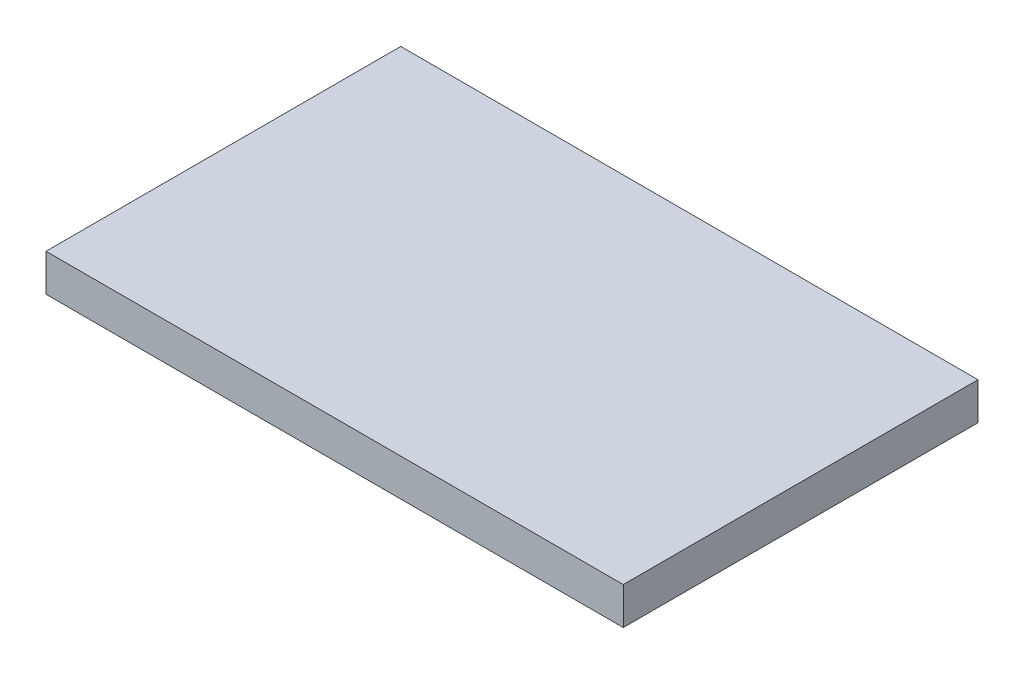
ISO-10303-21;
HEADER;
FILE_DESCRIPTION(('STEP AP214'),'2;1');
FILE_NAME('part.step','',(''),(''),'','','');
FILE_SCHEMA(('AUTOMOTIVE_DESIGN { 1 0 10303 214 1 1 1 1 }'));
ENDSEC;
DATA;
#1=APPLICATION_CONTEXT('core data for automotive mechanical design processes');
#2=APPLICATION_PROTOCOL_DEFINITION('international standard','automotive_design',2000,#1);
#3=PRODUCT_CONTEXT('',#1,'mechanical');
#4=PRODUCT('Part','Part','',(#3));
#5=PRODUCT_RELATED_PRODUCT_CATEGORY('part','',(#4));
#6=PRODUCT_DEFINITION_FORMATION('','',#4);
#7=PRODUCT_DEFINITION_CONTEXT('part definition',#1,'design');
#8=PRODUCT_DEFINITION('design','',#6,#7);
#9=PRODUCT_DEFINITION_SHAPE('','',#8);
#10=(LENGTH_UNIT() NAMED_UNIT(*) SI_UNIT(.MILLI.,.METRE.));
#11=(NAMED_UNIT(*) PLANE_ANGLE_UNIT() SI_UNIT($,.RADIAN.));
#12=(NAMED_UNIT(*) SI_UNIT($,.STERADIAN.) SOLID_ANGLE_UNIT());
#13=UNCERTAINTY_MEASURE_WITH_UNIT(LENGTH_MEASURE(1.E-05),#10,'distance_accuracy_value','');
#14=(GEOMETRIC_REPRESENTATION_CONTEXT(3) GLOBAL_UNCERTAINTY_ASSIGNED_CONTEXT((#13)) GLOBAL_UNIT_ASSIGNED_CONTEXT((#10,
#11,#12)) REPRESENTATION_CONTEXT('',''));
#15=CARTESIAN_POINT('',(0.,0.,0.));
#16=DIRECTION('',(0.,0.,1.));
#17=DIRECTION('',(1.,0.,0.));
#18=AXIS2_PLACEMENT_3D('',#15,#16,#17);
#19=CARTESIAN_POINT('',(3.09999888,-0.1999996,0.));
#20=DIRECTION('',(0.,-1.,0.));
#21=DIRECTION('',(0.,0.,-1.));
#22=AXIS2_PLACEMENT_3D('',#19,#20,#21);
#23=PLANE('',#22);
#24=DIRECTION('',(0.,0.,1.));
#25=VECTOR('',#24,1.);
#26=CARTESIAN_POINT('',(-3.09999888,-0.1999996,0.));
#27=LINE('',#26,#25);
#28=CARTESIAN_POINT('',(-3.09999888,-0.1999996,0.));
#29=VERTEX_POINT('',#28);
#30=CARTESIAN_POINT('',(-3.09999888,-0.1999996,3.81));
#31=VERTEX_POINT('',#30);
#32=EDGE_CURVE('E19',#29,#31,#27,.T.);
#33=ORIENTED_EDGE('',*,*,#32,.F.);
#34=DIRECTION('',(1.,0.,0.));
#35=VECTOR('',#34,1.);
#36=CARTESIAN_POINT('',(-3.09999888,-0.1999996,0.));
#37=LINE('',#36,#35);
#38=CARTESIAN_POINT('',(3.09999888,-0.1999996,0.));
#39=VERTEX_POINT('',#38);
#40=EDGE_CURVE('E79',#29,#39,#37,.T.);
#41=ORIENTED_EDGE('',*,*,#40,.T.);
#42=DIRECTION('',(0.,0.,-1.));
#43=VECTOR('',#42,1.);
#44=CARTESIAN_POINT('',(3.09999888,-0.1999996,0.));
#45=LINE('',#44,#43);
#46=CARTESIAN_POINT('',(3.09999888,-0.1999996,3.81));
#47=VERTEX_POINT('',#46);
#48=EDGE_CURVE('E67',#47,#39,#45,.T.);
#49=ORIENTED_EDGE('',*,*,#48,.F.);
#50=DIRECTION('',(1.,0.,0.));
#51=VECTOR('',#50,1.);
#52=CARTESIAN_POINT('',(-3.09999888,-0.1999996,3.81));
#53=LINE('',#52,#51);
#54=EDGE_CURVE('E55',#31,#47,#53,.T.);
#55=ORIENTED_EDGE('',*,*,#54,.F.);
#56=EDGE_LOOP('',(#33,#41,#49,#55));
#57=FACE_BOUND('',#56,.T.);
#58=ADVANCED_FACE('F16',(#57),#23,.T.);
#59=CARTESIAN_POINT('',(-3.09999888,-0.1999996,0.));
#60=DIRECTION('',(-1.,0.,0.));
#61=DIRECTION('',(0.,0.,1.));
#62=AXIS2_PLACEMENT_3D('',#59,#60,#61);
#63=PLANE('',#62);
#64=DIRECTION('',(0.,0.,1.));
#65=VECTOR('',#64,1.);
#66=CARTESIAN_POINT('',(-3.09999888,0.20000214,0.));
#67=LINE('',#66,#65);
#68=CARTESIAN_POINT('',(-3.09999888,0.20000214,0.));
#69=VERTEX_POINT('',#68);
#70=CARTESIAN_POINT('',(-3.09999888,0.20000214,3.81));
#71=VERTEX_POINT('',#70);
#72=EDGE_CURVE('E82',#69,#71,#67,.T.);
#73=ORIENTED_EDGE('',*,*,#72,.F.);
#74=DIRECTION('',(0.,1.,0.));
#75=VECTOR('',#74,1.);
#76=CARTESIAN_POINT('',(-3.09999888,0.20000214,0.));
#77=LINE('',#76,#75);
#78=EDGE_CURVE('E64',#69,#29,#77,.F.);
#79=ORIENTED_EDGE('',*,*,#78,.T.);
#80=ORIENTED_EDGE('',*,*,#32,.T.);
#81=DIRECTION('',(0.,1.,0.));
#82=VECTOR('',#81,1.);
#83=CARTESIAN_POINT('',(-3.09999888,0.20000214,3.81));
#84=LINE('',#83,#82);
#85=EDGE_CURVE('E61',#71,#31,#84,.F.);
#86=ORIENTED_EDGE('',*,*,#85,.F.);
#87=EDGE_LOOP('',(#73,#79,#80,#86));
#88=FACE_BOUND('',#87,.T.);
#89=ADVANCED_FACE('F60',(#88),#63,.T.);
#90=CARTESIAN_POINT('',(-3.09999888,0.20000214,3.81));
#91=DIRECTION('',(0.,0.,1.));
#92=DIRECTION('',(1.,0.,0.));
#93=AXIS2_PLACEMENT_3D('',#90,#91,#92);
#94=PLANE('',#93);
#95=DIRECTION('',(0.,1.,0.));
#96=VECTOR('',#95,1.);
#97=CARTESIAN_POINT('',(3.09999888,0.20000214,3.81));
#98=LINE('',#97,#96);
#99=CARTESIAN_POINT('',(3.09999888,0.20000214,3.81));
#100=VERTEX_POINT('',#99);
#101=EDGE_CURVE('E69',#100,#47,#98,.F.);
#102=ORIENTED_EDGE('',*,*,#101,.F.);
#103=DIRECTION('',(1.,0.,0.));
#104=VECTOR('',#103,1.);
#105=CARTESIAN_POINT('',(-3.09999888,0.20000214,3.81));
#106=LINE('',#105,#104);
#107=EDGE_CURVE('E73',#71,#100,#106,.T.);
#108=ORIENTED_EDGE('',*,*,#107,.F.);
#109=ORIENTED_EDGE('',*,*,#85,.T.);
#110=ORIENTED_EDGE('',*,*,#54,.T.);
#111=EDGE_LOOP('',(#102,#108,#109,#110));
#112=FACE_BOUND('',#111,.T.);
#113=ADVANCED_FACE('F71',(#112),#94,.T.);
#114=CARTESIAN_POINT('',(3.09999888,0.20000214,0.));
#115=DIRECTION('',(1.,0.,0.));
#116=DIRECTION('',(0.,0.,-1.));
#117=AXIS2_PLACEMENT_3D('',#114,#115,#116);
#118=PLANE('',#117);
#119=ORIENTED_EDGE('',*,*,#48,.T.);
#120=DIRECTION('',(0.,1.,0.));
#121=VECTOR('',#120,1.);
#122=CARTESIAN_POINT('',(3.09999888,0.20000214,0.));
#123=LINE('',#122,#121);
#124=CARTESIAN_POINT('',(3.09999888,0.20000214,0.));
#125=VERTEX_POINT('',#124);
#126=EDGE_CURVE('E34',#39,#125,#123,.T.);
#127=ORIENTED_EDGE('',*,*,#126,.T.);
#128=DIRECTION('',(0.,0.,1.));
#129=VECTOR('',#128,1.);
#130=CARTESIAN_POINT('',(3.09999888,0.20000214,0.));
#131=LINE('',#130,#129);
#132=EDGE_CURVE('E25',#100,#125,#131,.F.);
#133=ORIENTED_EDGE('',*,*,#132,.F.);
#134=ORIENTED_EDGE('',*,*,#101,.T.);
#135=EDGE_LOOP('',(#119,#127,#133,#134));
#136=FACE_BOUND('',#135,.T.);
#137=ADVANCED_FACE('F88',(#136),#118,.T.);
#138=CARTESIAN_POINT('',(-3.09999888,0.20000214,0.));
#139=DIRECTION('',(0.,0.,1.));
#140=DIRECTION('',(1.,0.,0.));
#141=AXIS2_PLACEMENT_3D('',#138,#139,#140);
#142=PLANE('',#141);
#143=ORIENTED_EDGE('',*,*,#126,.F.);
#144=ORIENTED_EDGE('',*,*,#40,.F.);
#145=ORIENTED_EDGE('',*,*,#78,.F.);
#146=DIRECTION('',(1.,0.,0.));
#147=VECTOR('',#146,1.);
#148=CARTESIAN_POINT('',(-3.09999888,0.20000214,0.));
#149=LINE('',#148,#147);
#150=EDGE_CURVE('E11',#125,#69,#149,.F.);
#151=ORIENTED_EDGE('',*,*,#150,.F.);
#152=EDGE_LOOP('',(#143,#144,#145,#151));
#153=FACE_BOUND('',#152,.T.);
#154=ADVANCED_FACE('F90',(#153),#142,.F.);
#155=CARTESIAN_POINT('',(-3.09999888,0.20000214,0.));
#156=DIRECTION('',(0.,1.,0.));
#157=DIRECTION('',(0.,0.,1.));
#158=AXIS2_PLACEMENT_3D('',#155,#156,#157);
#159=PLANE('',#158);
#160=ORIENTED_EDGE('',*,*,#132,.T.);
#161=ORIENTED_EDGE('',*,*,#150,.T.);
#162=ORIENTED_EDGE('',*,*,#72,.T.);
#163=ORIENTED_EDGE('',*,*,#107,.T.);
#164=EDGE_LOOP('',(#160,#161,#162,#163));
#165=FACE_BOUND('',#164,.T.);
#166=ADVANCED_FACE('F87',(#165),#159,.T.);
#167=CLOSED_SHELL('',(#58,#89,#113,#137,#154,#166));
#168=MANIFOLD_SOLID_BREP('B1',#167);
#169=ADVANCED_BREP_SHAPE_REPRESENTATION('',(#18,#168),#14);
#170=SHAPE_DEFINITION_REPRESENTATION(#9,#169);
ENDSEC;
END-ISO-10303-21;
